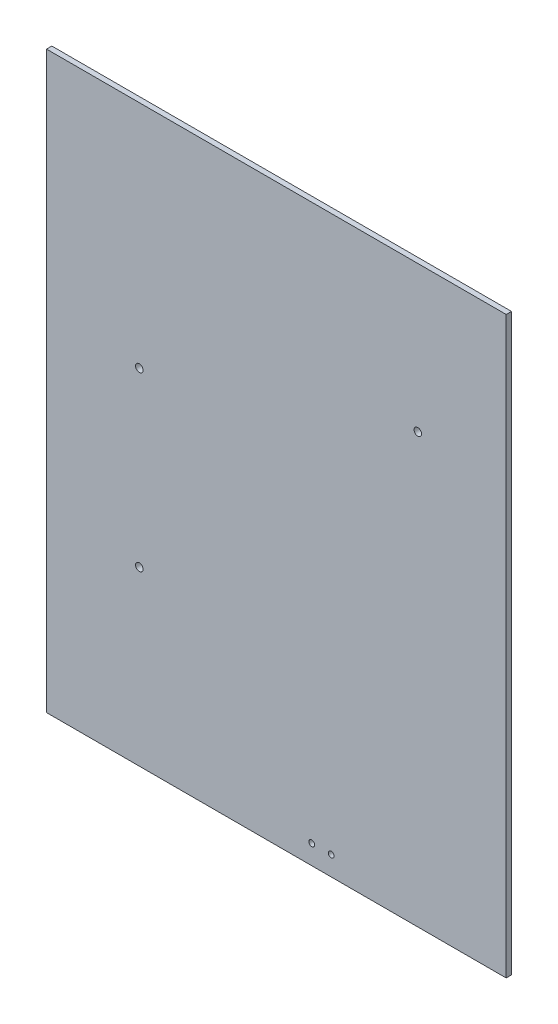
ISO-10303-21;
HEADER;
FILE_DESCRIPTION(('STEP AP214'),'2;1');
FILE_NAME('part.step','',(''),(''),'','','');
FILE_SCHEMA(('AUTOMOTIVE_DESIGN { 1 0 10303 214 1 1 1 1 }'));
ENDSEC;
DATA;
#1=APPLICATION_CONTEXT('core data for automotive mechanical design processes');
#2=APPLICATION_PROTOCOL_DEFINITION('international standard','automotive_design',2000,#1);
#3=PRODUCT_CONTEXT('',#1,'mechanical');
#4=PRODUCT('Part','Part','',(#3));
#5=PRODUCT_RELATED_PRODUCT_CATEGORY('part','',(#4));
#6=PRODUCT_DEFINITION_FORMATION('','',#4);
#7=PRODUCT_DEFINITION_CONTEXT('part definition',#1,'design');
#8=PRODUCT_DEFINITION('design','',#6,#7);
#9=PRODUCT_DEFINITION_SHAPE('','',#8);
#10=(LENGTH_UNIT() NAMED_UNIT(*) SI_UNIT(.MILLI.,.METRE.));
#11=(NAMED_UNIT(*) PLANE_ANGLE_UNIT() SI_UNIT($,.RADIAN.));
#12=(NAMED_UNIT(*) SI_UNIT($,.STERADIAN.) SOLID_ANGLE_UNIT());
#13=UNCERTAINTY_MEASURE_WITH_UNIT(LENGTH_MEASURE(1.E-05),#10,'distance_accuracy_value','');
#14=(GEOMETRIC_REPRESENTATION_CONTEXT(3) GLOBAL_UNCERTAINTY_ASSIGNED_CONTEXT((#13)) GLOBAL_UNIT_ASSIGNED_CONTEXT((#10,
#11,#12)) REPRESENTATION_CONTEXT('',''));
#15=CARTESIAN_POINT('',(0.,0.,0.));
#16=DIRECTION('',(0.,0.,1.));
#17=DIRECTION('',(1.,0.,0.));
#18=AXIS2_PLACEMENT_3D('',#15,#16,#17);
#19=CARTESIAN_POINT('',(0.,0.,6.));
#20=DIRECTION('',(1.,0.,0.));
#21=DIRECTION('',(0.,0.,-1.));
#22=AXIS2_PLACEMENT_3D('',#19,#20,#21);
#23=PLANE('',#22);
#24=DIRECTION('',(0.,-1.,0.));
#25=VECTOR('',#24,1.);
#26=CARTESIAN_POINT('',(0.,0.,0.));
#27=LINE('',#26,#25);
#28=CARTESIAN_POINT('',(0.,650.,0.));
#29=VERTEX_POINT('',#28);
#30=CARTESIAN_POINT('',(0.,0.,0.));
#31=VERTEX_POINT('',#30);
#32=EDGE_CURVE('E76',#29,#31,#27,.T.);
#33=ORIENTED_EDGE('',*,*,#32,.T.);
#34=DIRECTION('',(0.,0.,-1.));
#35=VECTOR('',#34,1.);
#36=CARTESIAN_POINT('',(0.,0.,6.));
#37=LINE('',#36,#35);
#38=CARTESIAN_POINT('',(0.,0.,6.));
#39=VERTEX_POINT('',#38);
#40=EDGE_CURVE('E11',#39,#31,#37,.T.);
#41=ORIENTED_EDGE('',*,*,#40,.F.);
#42=DIRECTION('',(0.,-1.,0.));
#43=VECTOR('',#42,1.);
#44=CARTESIAN_POINT('',(0.,0.,6.));
#45=LINE('',#44,#43);
#46=CARTESIAN_POINT('',(0.,650.,6.));
#47=VERTEX_POINT('',#46);
#48=EDGE_CURVE('E99',#47,#39,#45,.T.);
#49=ORIENTED_EDGE('',*,*,#48,.F.);
#50=DIRECTION('',(0.,0.,-1.));
#51=VECTOR('',#50,1.);
#52=CARTESIAN_POINT('',(0.,650.,6.));
#53=LINE('',#52,#51);
#54=EDGE_CURVE('E88',#47,#29,#53,.T.);
#55=ORIENTED_EDGE('',*,*,#54,.T.);
#56=EDGE_LOOP('',(#33,#41,#49,#55));
#57=FACE_BOUND('',#56,.T.);
#58=ADVANCED_FACE('F32',(#57),#23,.F.);
#59=CARTESIAN_POINT('',(0.,0.,6.));
#60=DIRECTION('',(0.,1.,0.));
#61=DIRECTION('',(0.,0.,1.));
#62=AXIS2_PLACEMENT_3D('',#59,#60,#61);
#63=PLANE('',#62);
#64=DIRECTION('',(1.,0.,0.));
#65=VECTOR('',#64,1.);
#66=CARTESIAN_POINT('',(0.,0.,0.));
#67=LINE('',#66,#65);
#68=CARTESIAN_POINT('',(520.,0.,0.));
#69=VERTEX_POINT('',#68);
#70=EDGE_CURVE('E72',#31,#69,#67,.T.);
#71=ORIENTED_EDGE('',*,*,#70,.T.);
#72=DIRECTION('',(0.,0.,-1.));
#73=VECTOR('',#72,1.);
#74=CARTESIAN_POINT('',(520.,0.,6.));
#75=LINE('',#74,#73);
#76=CARTESIAN_POINT('',(520.,0.,6.));
#77=VERTEX_POINT('',#76);
#78=EDGE_CURVE('E39',#77,#69,#75,.T.);
#79=ORIENTED_EDGE('',*,*,#78,.F.);
#80=DIRECTION('',(1.,0.,0.));
#81=VECTOR('',#80,1.);
#82=CARTESIAN_POINT('',(0.,0.,6.));
#83=LINE('',#82,#81);
#84=EDGE_CURVE('E84',#39,#77,#83,.T.);
#85=ORIENTED_EDGE('',*,*,#84,.F.);
#86=ORIENTED_EDGE('',*,*,#40,.T.);
#87=EDGE_LOOP('',(#71,#79,#85,#86));
#88=FACE_BOUND('',#87,.T.);
#89=ADVANCED_FACE('F83',(#88),#63,.F.);
#90=CARTESIAN_POINT('',(520.,0.,6.));
#91=DIRECTION('',(-1.,0.,0.));
#92=DIRECTION('',(0.,0.,1.));
#93=AXIS2_PLACEMENT_3D('',#90,#91,#92);
#94=PLANE('',#93);
#95=DIRECTION('',(0.,1.,0.));
#96=VECTOR('',#95,1.);
#97=CARTESIAN_POINT('',(520.,0.,0.));
#98=LINE('',#97,#96);
#99=CARTESIAN_POINT('',(520.,650.,0.));
#100=VERTEX_POINT('',#99);
#101=EDGE_CURVE('E77',#69,#100,#98,.T.);
#102=ORIENTED_EDGE('',*,*,#101,.T.);
#103=DIRECTION('',(0.,0.,-1.));
#104=VECTOR('',#103,1.);
#105=CARTESIAN_POINT('',(520.,650.,6.));
#106=LINE('',#105,#104);
#107=CARTESIAN_POINT('',(520.,650.,6.));
#108=VERTEX_POINT('',#107);
#109=EDGE_CURVE('E105',#108,#100,#106,.T.);
#110=ORIENTED_EDGE('',*,*,#109,.F.);
#111=DIRECTION('',(0.,1.,0.));
#112=VECTOR('',#111,1.);
#113=CARTESIAN_POINT('',(520.,0.,6.));
#114=LINE('',#113,#112);
#115=EDGE_CURVE('E51',#77,#108,#114,.T.);
#116=ORIENTED_EDGE('',*,*,#115,.F.);
#117=ORIENTED_EDGE('',*,*,#78,.T.);
#118=EDGE_LOOP('',(#102,#110,#116,#117));
#119=FACE_BOUND('',#118,.T.);
#120=ADVANCED_FACE('F108',(#119),#94,.F.);
#121=CARTESIAN_POINT('',(0.,650.,6.));
#122=DIRECTION('',(0.,-1.,0.));
#123=DIRECTION('',(0.,0.,-1.));
#124=AXIS2_PLACEMENT_3D('',#121,#122,#123);
#125=PLANE('',#124);
#126=DIRECTION('',(-1.,0.,0.));
#127=VECTOR('',#126,1.);
#128=CARTESIAN_POINT('',(0.,650.,0.));
#129=LINE('',#128,#127);
#130=EDGE_CURVE('E97',#100,#29,#129,.T.);
#131=ORIENTED_EDGE('',*,*,#130,.T.);
#132=ORIENTED_EDGE('',*,*,#54,.F.);
#133=DIRECTION('',(-1.,0.,0.));
#134=VECTOR('',#133,1.);
#135=CARTESIAN_POINT('',(0.,650.,6.));
#136=LINE('',#135,#134);
#137=EDGE_CURVE('E46',#108,#47,#136,.T.);
#138=ORIENTED_EDGE('',*,*,#137,.F.);
#139=ORIENTED_EDGE('',*,*,#109,.T.);
#140=EDGE_LOOP('',(#131,#132,#138,#139));
#141=FACE_BOUND('',#140,.T.);
#142=ADVANCED_FACE('F110',(#141),#125,.F.);
#143=CARTESIAN_POINT('',(0.,650.,6.));
#144=DIRECTION('',(0.,0.,-1.));
#145=DIRECTION('',(-1.,0.,0.));
#146=AXIS2_PLACEMENT_3D('',#143,#144,#145);
#147=PLANE('',#146);
#148=CARTESIAN_POINT('',(322.,22.,6.));
#149=DIRECTION('',(0.,0.,1.));
#150=DIRECTION('',(1.,0.,0.));
#151=AXIS2_PLACEMENT_3D('',#148,#149,#150);
#152=CIRCLE('',#151,3.24999999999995);
#153=CARTESIAN_POINT('',(325.25,22.,6.));
#154=VERTEX_POINT('',#153);
#155=EDGE_CURVE('E207',#154,#154,#152,.T.);
#156=ORIENTED_EDGE('',*,*,#155,.F.);
#157=EDGE_LOOP('',(#156));
#158=FACE_BOUND('',#157,.T.);
#159=CARTESIAN_POINT('',(300.,22.,6.));
#160=DIRECTION('',(0.,0.,1.));
#161=DIRECTION('',(1.,0.,0.));
#162=AXIS2_PLACEMENT_3D('',#159,#160,#161);
#163=CIRCLE('',#162,3.25000000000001);
#164=CARTESIAN_POINT('',(303.25,22.,6.));
#165=VERTEX_POINT('',#164);
#166=EDGE_CURVE('E211',#165,#165,#163,.T.);
#167=ORIENTED_EDGE('',*,*,#166,.F.);
#168=EDGE_LOOP('',(#167));
#169=FACE_BOUND('',#168,.T.);
#170=CARTESIAN_POINT('',(105.,195.,6.));
#171=DIRECTION('',(0.,0.,1.));
#172=DIRECTION('',(1.,0.,0.));
#173=AXIS2_PLACEMENT_3D('',#170,#171,#172);
#174=CIRCLE('',#173,4.25000000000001);
#175=CARTESIAN_POINT('',(109.25,195.,6.));
#176=VERTEX_POINT('',#175);
#177=EDGE_CURVE('E218',#176,#176,#174,.T.);
#178=ORIENTED_EDGE('',*,*,#177,.F.);
#179=EDGE_LOOP('',(#178));
#180=FACE_BOUND('',#179,.T.);
#181=CARTESIAN_POINT('',(105.,390.,6.));
#182=DIRECTION('',(0.,0.,1.));
#183=DIRECTION('',(1.,0.,0.));
#184=AXIS2_PLACEMENT_3D('',#181,#182,#183);
#185=CIRCLE('',#184,4.24999999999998);
#186=CARTESIAN_POINT('',(109.25,390.,6.));
#187=VERTEX_POINT('',#186);
#188=EDGE_CURVE('E224',#187,#187,#185,.T.);
#189=ORIENTED_EDGE('',*,*,#188,.F.);
#190=EDGE_LOOP('',(#189));
#191=FACE_BOUND('',#190,.T.);
#192=CARTESIAN_POINT('',(420.,485.,6.));
#193=DIRECTION('',(0.,0.,1.));
#194=DIRECTION('',(1.,0.,0.));
#195=AXIS2_PLACEMENT_3D('',#192,#193,#194);
#196=CIRCLE('',#195,4.24999999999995);
#197=CARTESIAN_POINT('',(424.25,485.,6.));
#198=VERTEX_POINT('',#197);
#199=EDGE_CURVE('E89',#198,#198,#196,.T.);
#200=ORIENTED_EDGE('',*,*,#199,.F.);
#201=EDGE_LOOP('',(#200));
#202=FACE_BOUND('',#201,.T.);
#203=ORIENTED_EDGE('',*,*,#48,.T.);
#204=ORIENTED_EDGE('',*,*,#84,.T.);
#205=ORIENTED_EDGE('',*,*,#115,.T.);
#206=ORIENTED_EDGE('',*,*,#137,.T.);
#207=EDGE_LOOP('',(#203,#204,#205,#206));
#208=FACE_BOUND('',#207,.T.);
#209=ADVANCED_FACE('F111',(#158,#169,#180,#191,#202,#208),#147,.F.);
#210=CARTESIAN_POINT('',(0.,650.,0.));
#211=DIRECTION('',(0.,0.,-1.));
#212=DIRECTION('',(-1.,0.,0.));
#213=AXIS2_PLACEMENT_3D('',#210,#211,#212);
#214=PLANE('',#213);
#215=CARTESIAN_POINT('',(322.,22.,0.));
#216=DIRECTION('',(0.,0.,-1.));
#217=DIRECTION('',(-1.,0.,0.));
#218=AXIS2_PLACEMENT_3D('',#215,#216,#217);
#219=CIRCLE('',#218,3.24999999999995);
#220=CARTESIAN_POINT('',(325.25,22.,0.));
#221=VERTEX_POINT('',#220);
#222=EDGE_CURVE('E205',#221,#221,#219,.F.);
#223=ORIENTED_EDGE('',*,*,#222,.T.);
#224=EDGE_LOOP('',(#223));
#225=FACE_BOUND('',#224,.T.);
#226=CARTESIAN_POINT('',(300.,22.,0.));
#227=DIRECTION('',(0.,0.,-1.));
#228=DIRECTION('',(-1.,0.,0.));
#229=AXIS2_PLACEMENT_3D('',#226,#227,#228);
#230=CIRCLE('',#229,3.25000000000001);
#231=CARTESIAN_POINT('',(303.25,22.,0.));
#232=VERTEX_POINT('',#231);
#233=EDGE_CURVE('E208',#232,#232,#230,.F.);
#234=ORIENTED_EDGE('',*,*,#233,.T.);
#235=EDGE_LOOP('',(#234));
#236=FACE_BOUND('',#235,.T.);
#237=CARTESIAN_POINT('',(105.,195.,0.));
#238=DIRECTION('',(0.,0.,-1.));
#239=DIRECTION('',(-1.,0.,0.));
#240=AXIS2_PLACEMENT_3D('',#237,#238,#239);
#241=CIRCLE('',#240,4.25000000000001);
#242=CARTESIAN_POINT('',(109.25,195.,0.));
#243=VERTEX_POINT('',#242);
#244=EDGE_CURVE('E216',#243,#243,#241,.F.);
#245=ORIENTED_EDGE('',*,*,#244,.T.);
#246=EDGE_LOOP('',(#245));
#247=FACE_BOUND('',#246,.T.);
#248=CARTESIAN_POINT('',(105.,390.,0.));
#249=DIRECTION('',(0.,0.,-1.));
#250=DIRECTION('',(-1.,0.,0.));
#251=AXIS2_PLACEMENT_3D('',#248,#249,#250);
#252=CIRCLE('',#251,4.24999999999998);
#253=CARTESIAN_POINT('',(109.25,390.,0.));
#254=VERTEX_POINT('',#253);
#255=EDGE_CURVE('E221',#254,#254,#252,.F.);
#256=ORIENTED_EDGE('',*,*,#255,.T.);
#257=EDGE_LOOP('',(#256));
#258=FACE_BOUND('',#257,.T.);
#259=CARTESIAN_POINT('',(420.,485.,0.));
#260=DIRECTION('',(0.,0.,-1.));
#261=DIRECTION('',(-1.,0.,0.));
#262=AXIS2_PLACEMENT_3D('',#259,#260,#261);
#263=CIRCLE('',#262,4.24999999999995);
#264=CARTESIAN_POINT('',(424.25,485.,0.));
#265=VERTEX_POINT('',#264);
#266=EDGE_CURVE('E92',#265,#265,#263,.F.);
#267=ORIENTED_EDGE('',*,*,#266,.T.);
#268=EDGE_LOOP('',(#267));
#269=FACE_BOUND('',#268,.T.);
#270=ORIENTED_EDGE('',*,*,#32,.F.);
#271=ORIENTED_EDGE('',*,*,#130,.F.);
#272=ORIENTED_EDGE('',*,*,#101,.F.);
#273=ORIENTED_EDGE('',*,*,#70,.F.);
#274=EDGE_LOOP('',(#270,#271,#272,#273));
#275=FACE_BOUND('',#274,.T.);
#276=ADVANCED_FACE('F73',(#225,#236,#247,#258,#269,#275),#214,.T.);
#277=CARTESIAN_POINT('',(420.,485.,-0.00100000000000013));
#278=DIRECTION('',(0.,0.,1.));
#279=DIRECTION('',(1.,0.,0.));
#280=AXIS2_PLACEMENT_3D('',#277,#278,#279);
#281=CYLINDRICAL_SURFACE('',#280,4.24999999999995);
#282=CARTESIAN_POINT('',(424.25,485.,0.));
#283=CARTESIAN_POINT('',(424.25,485.,0.0624999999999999));
#284=CARTESIAN_POINT('',(424.25,485.,0.125));
#285=CARTESIAN_POINT('',(424.25,485.,0.25));
#286=CARTESIAN_POINT('',(424.25,485.,0.3125));
#287=CARTESIAN_POINT('',(424.25,485.,0.4375));
#288=CARTESIAN_POINT('',(424.25,485.,0.5));
#289=CARTESIAN_POINT('',(424.25,485.,0.625));
#290=CARTESIAN_POINT('',(424.25,485.,0.6875));
#291=CARTESIAN_POINT('',(424.25,485.,0.8125));
#292=CARTESIAN_POINT('',(424.25,485.,0.875));
#293=CARTESIAN_POINT('',(424.25,485.,1.));
#294=CARTESIAN_POINT('',(424.25,485.,1.0625));
#295=CARTESIAN_POINT('',(424.25,485.,1.1875));
#296=CARTESIAN_POINT('',(424.25,485.,1.25));
#297=CARTESIAN_POINT('',(424.25,485.,1.375));
#298=CARTESIAN_POINT('',(424.25,485.,1.4375));
#299=CARTESIAN_POINT('',(424.25,485.,1.5625));
#300=CARTESIAN_POINT('',(424.25,485.,1.625));
#301=CARTESIAN_POINT('',(424.25,485.,1.75));
#302=CARTESIAN_POINT('',(424.25,485.,1.8125));
#303=CARTESIAN_POINT('',(424.25,485.,1.9375));
#304=CARTESIAN_POINT('',(424.25,485.,2.));
#305=CARTESIAN_POINT('',(424.25,485.,2.125));
#306=CARTESIAN_POINT('',(424.25,485.,2.1875));
#307=CARTESIAN_POINT('',(424.25,485.,2.3125));
#308=CARTESIAN_POINT('',(424.25,485.,2.375));
#309=CARTESIAN_POINT('',(424.25,485.,2.5));
#310=CARTESIAN_POINT('',(424.25,485.,2.5625));
#311=CARTESIAN_POINT('',(424.25,485.,2.6875));
#312=CARTESIAN_POINT('',(424.25,485.,2.75));
#313=CARTESIAN_POINT('',(424.25,485.,2.875));
#314=CARTESIAN_POINT('',(424.25,485.,2.9375));
#315=CARTESIAN_POINT('',(424.25,485.,3.0625));
#316=CARTESIAN_POINT('',(424.25,485.,3.125));
#317=CARTESIAN_POINT('',(424.25,485.,3.25));
#318=CARTESIAN_POINT('',(424.25,485.,3.3125));
#319=CARTESIAN_POINT('',(424.25,485.,3.4375));
#320=CARTESIAN_POINT('',(424.25,485.,3.5));
#321=CARTESIAN_POINT('',(424.25,485.,3.625));
#322=CARTESIAN_POINT('',(424.25,485.,3.6875));
#323=CARTESIAN_POINT('',(424.25,485.,3.8125));
#324=CARTESIAN_POINT('',(424.25,485.,3.875));
#325=CARTESIAN_POINT('',(424.25,485.,4.));
#326=CARTESIAN_POINT('',(424.25,485.,4.0625));
#327=CARTESIAN_POINT('',(424.25,485.,4.1875));
#328=CARTESIAN_POINT('',(424.25,485.,4.25));
#329=CARTESIAN_POINT('',(424.25,485.,4.375));
#330=CARTESIAN_POINT('',(424.25,485.,4.4375));
#331=CARTESIAN_POINT('',(424.25,485.,4.5625));
#332=CARTESIAN_POINT('',(424.25,485.,4.625));
#333=CARTESIAN_POINT('',(424.25,485.,4.75));
#334=CARTESIAN_POINT('',(424.25,485.,4.8125));
#335=CARTESIAN_POINT('',(424.25,485.,4.9375));
#336=CARTESIAN_POINT('',(424.25,485.,5.));
#337=CARTESIAN_POINT('',(424.25,485.,5.125));
#338=CARTESIAN_POINT('',(424.25,485.,5.1875));
#339=CARTESIAN_POINT('',(424.25,485.,5.3125));
#340=CARTESIAN_POINT('',(424.25,485.,5.375));
#341=CARTESIAN_POINT('',(424.25,485.,5.5));
#342=CARTESIAN_POINT('',(424.25,485.,5.5625));
#343=CARTESIAN_POINT('',(424.25,485.,5.6875));
#344=CARTESIAN_POINT('',(424.25,485.,5.75));
#345=CARTESIAN_POINT('',(424.25,485.,5.875));
#346=CARTESIAN_POINT('',(424.25,485.,5.9375));
#347=CARTESIAN_POINT('',(424.25,485.,6.));
#348=B_SPLINE_CURVE_WITH_KNOTS('',3,(#282,#283,#284,#285,#286,#287,#288,#289,#290,#291,#292,
#293,#294,#295,#296,#297,#298,#299,#300,#301,#302,#303,#304,#305,#306,#307,#308,#309,#310,#311,
#312,#313,#314,#315,#316,#317,#318,#319,#320,#321,#322,#323,#324,#325,#326,#327,#328,#329,#330,
#331,#332,#333,#334,#335,#336,#337,#338,#339,#340,#341,#342,#343,#344,#345,#346,#347),
.UNSPECIFIED.,.F.,.F.,(4,2,2,2,2,2,2,2,2,2,2,2,2,2,2,2,2,2,2,2,2,2,2,2,2,2,2,2,2,2,2,2,4),(0.,
0.1875,0.375,0.5625,0.75,0.9375,1.125,1.3125,1.5,1.6875,1.875,2.0625,2.25,2.4375,2.625,2.8125,
3.,3.1875,3.375,3.5625,3.75,3.9375,4.125,4.3125,4.5,4.6875,4.875,5.0625,5.25,5.4375,5.625,
5.8125,6.),.UNSPECIFIED.);
#349=EDGE_CURVE('BSEAM119',#265,#198,#348,.T.);
#350=ORIENTED_EDGE('',*,*,#266,.F.);
#351=ORIENTED_EDGE('',*,*,#199,.T.);
#352=ORIENTED_EDGE('',*,*,#349,.T.);
#353=ORIENTED_EDGE('',*,*,#349,.F.);
#354=EDGE_LOOP('',(#350,#352,#351,#353));
#355=FACE_BOUND('',#354,.T.);
#356=ADVANCED_FACE('F119',(#355),#281,.F.);
#357=CARTESIAN_POINT('',(105.,390.,-0.00100000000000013));
#358=DIRECTION('',(0.,0.,1.));
#359=DIRECTION('',(1.,0.,0.));
#360=AXIS2_PLACEMENT_3D('',#357,#358,#359);
#361=CYLINDRICAL_SURFACE('',#360,4.24999999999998);
#362=CARTESIAN_POINT('',(109.25,390.,0.));
#363=CARTESIAN_POINT('',(109.25,390.,0.0624999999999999));
#364=CARTESIAN_POINT('',(109.25,390.,0.125));
#365=CARTESIAN_POINT('',(109.25,390.,0.25));
#366=CARTESIAN_POINT('',(109.25,390.,0.3125));
#367=CARTESIAN_POINT('',(109.25,390.,0.4375));
#368=CARTESIAN_POINT('',(109.25,390.,0.5));
#369=CARTESIAN_POINT('',(109.25,390.,0.625));
#370=CARTESIAN_POINT('',(109.25,390.,0.6875));
#371=CARTESIAN_POINT('',(109.25,390.,0.8125));
#372=CARTESIAN_POINT('',(109.25,390.,0.875));
#373=CARTESIAN_POINT('',(109.25,390.,1.));
#374=CARTESIAN_POINT('',(109.25,390.,1.0625));
#375=CARTESIAN_POINT('',(109.25,390.,1.1875));
#376=CARTESIAN_POINT('',(109.25,390.,1.25));
#377=CARTESIAN_POINT('',(109.25,390.,1.375));
#378=CARTESIAN_POINT('',(109.25,390.,1.4375));
#379=CARTESIAN_POINT('',(109.25,390.,1.5625));
#380=CARTESIAN_POINT('',(109.25,390.,1.625));
#381=CARTESIAN_POINT('',(109.25,390.,1.75));
#382=CARTESIAN_POINT('',(109.25,390.,1.8125));
#383=CARTESIAN_POINT('',(109.25,390.,1.9375));
#384=CARTESIAN_POINT('',(109.25,390.,2.));
#385=CARTESIAN_POINT('',(109.25,390.,2.125));
#386=CARTESIAN_POINT('',(109.25,390.,2.1875));
#387=CARTESIAN_POINT('',(109.25,390.,2.3125));
#388=CARTESIAN_POINT('',(109.25,390.,2.375));
#389=CARTESIAN_POINT('',(109.25,390.,2.5));
#390=CARTESIAN_POINT('',(109.25,390.,2.5625));
#391=CARTESIAN_POINT('',(109.25,390.,2.6875));
#392=CARTESIAN_POINT('',(109.25,390.,2.75));
#393=CARTESIAN_POINT('',(109.25,390.,2.875));
#394=CARTESIAN_POINT('',(109.25,390.,2.9375));
#395=CARTESIAN_POINT('',(109.25,390.,3.0625));
#396=CARTESIAN_POINT('',(109.25,390.,3.125));
#397=CARTESIAN_POINT('',(109.25,390.,3.25));
#398=CARTESIAN_POINT('',(109.25,390.,3.3125));
#399=CARTESIAN_POINT('',(109.25,390.,3.4375));
#400=CARTESIAN_POINT('',(109.25,390.,3.5));
#401=CARTESIAN_POINT('',(109.25,390.,3.625));
#402=CARTESIAN_POINT('',(109.25,390.,3.6875));
#403=CARTESIAN_POINT('',(109.25,390.,3.8125));
#404=CARTESIAN_POINT('',(109.25,390.,3.875));
#405=CARTESIAN_POINT('',(109.25,390.,4.));
#406=CARTESIAN_POINT('',(109.25,390.,4.0625));
#407=CARTESIAN_POINT('',(109.25,390.,4.1875));
#408=CARTESIAN_POINT('',(109.25,390.,4.25));
#409=CARTESIAN_POINT('',(109.25,390.,4.375));
#410=CARTESIAN_POINT('',(109.25,390.,4.4375));
#411=CARTESIAN_POINT('',(109.25,390.,4.5625));
#412=CARTESIAN_POINT('',(109.25,390.,4.625));
#413=CARTESIAN_POINT('',(109.25,390.,4.75));
#414=CARTESIAN_POINT('',(109.25,390.,4.8125));
#415=CARTESIAN_POINT('',(109.25,390.,4.9375));
#416=CARTESIAN_POINT('',(109.25,390.,5.));
#417=CARTESIAN_POINT('',(109.25,390.,5.125));
#418=CARTESIAN_POINT('',(109.25,390.,5.1875));
#419=CARTESIAN_POINT('',(109.25,390.,5.3125));
#420=CARTESIAN_POINT('',(109.25,390.,5.375));
#421=CARTESIAN_POINT('',(109.25,390.,5.5));
#422=CARTESIAN_POINT('',(109.25,390.,5.5625));
#423=CARTESIAN_POINT('',(109.25,390.,5.6875));
#424=CARTESIAN_POINT('',(109.25,390.,5.75));
#425=CARTESIAN_POINT('',(109.25,390.,5.875));
#426=CARTESIAN_POINT('',(109.25,390.,5.9375));
#427=CARTESIAN_POINT('',(109.25,390.,6.));
#428=B_SPLINE_CURVE_WITH_KNOTS('',3,(#362,#363,#364,#365,#366,#367,#368,#369,#370,#371,#372,
#373,#374,#375,#376,#377,#378,#379,#380,#381,#382,#383,#384,#385,#386,#387,#388,#389,#390,#391,
#392,#393,#394,#395,#396,#397,#398,#399,#400,#401,#402,#403,#404,#405,#406,#407,#408,#409,#410,
#411,#412,#413,#414,#415,#416,#417,#418,#419,#420,#421,#422,#423,#424,#425,#426,#427),
.UNSPECIFIED.,.F.,.F.,(4,2,2,2,2,2,2,2,2,2,2,2,2,2,2,2,2,2,2,2,2,2,2,2,2,2,2,2,2,2,2,2,4),(0.,
0.1875,0.375,0.5625,0.75,0.9375,1.125,1.3125,1.5,1.6875,1.875,2.0625,2.25,2.4375,2.625,2.8125,
3.,3.1875,3.375,3.5625,3.75,3.9375,4.125,4.3125,4.5,4.6875,4.875,5.0625,5.25,5.4375,5.625,
5.8125,6.),.UNSPECIFIED.);
#429=EDGE_CURVE('BSEAM158',#254,#187,#428,.T.);
#430=ORIENTED_EDGE('',*,*,#255,.F.);
#431=ORIENTED_EDGE('',*,*,#188,.T.);
#432=ORIENTED_EDGE('',*,*,#429,.T.);
#433=ORIENTED_EDGE('',*,*,#429,.F.);
#434=EDGE_LOOP('',(#430,#432,#431,#433));
#435=FACE_BOUND('',#434,.T.);
#436=ADVANCED_FACE('F158',(#435),#361,.F.);
#437=CARTESIAN_POINT('',(105.,195.,-0.00100000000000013));
#438=DIRECTION('',(0.,0.,1.));
#439=DIRECTION('',(1.,0.,0.));
#440=AXIS2_PLACEMENT_3D('',#437,#438,#439);
#441=CYLINDRICAL_SURFACE('',#440,4.25000000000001);
#442=CARTESIAN_POINT('',(109.25,195.,0.));
#443=CARTESIAN_POINT('',(109.25,195.,0.0624999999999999));
#444=CARTESIAN_POINT('',(109.25,195.,0.125));
#445=CARTESIAN_POINT('',(109.25,195.,0.25));
#446=CARTESIAN_POINT('',(109.25,195.,0.3125));
#447=CARTESIAN_POINT('',(109.25,195.,0.4375));
#448=CARTESIAN_POINT('',(109.25,195.,0.5));
#449=CARTESIAN_POINT('',(109.25,195.,0.625));
#450=CARTESIAN_POINT('',(109.25,195.,0.6875));
#451=CARTESIAN_POINT('',(109.25,195.,0.8125));
#452=CARTESIAN_POINT('',(109.25,195.,0.875));
#453=CARTESIAN_POINT('',(109.25,195.,1.));
#454=CARTESIAN_POINT('',(109.25,195.,1.0625));
#455=CARTESIAN_POINT('',(109.25,195.,1.1875));
#456=CARTESIAN_POINT('',(109.25,195.,1.25));
#457=CARTESIAN_POINT('',(109.25,195.,1.375));
#458=CARTESIAN_POINT('',(109.25,195.,1.4375));
#459=CARTESIAN_POINT('',(109.25,195.,1.5625));
#460=CARTESIAN_POINT('',(109.25,195.,1.625));
#461=CARTESIAN_POINT('',(109.25,195.,1.75));
#462=CARTESIAN_POINT('',(109.25,195.,1.8125));
#463=CARTESIAN_POINT('',(109.25,195.,1.9375));
#464=CARTESIAN_POINT('',(109.25,195.,2.));
#465=CARTESIAN_POINT('',(109.25,195.,2.125));
#466=CARTESIAN_POINT('',(109.25,195.,2.1875));
#467=CARTESIAN_POINT('',(109.25,195.,2.3125));
#468=CARTESIAN_POINT('',(109.25,195.,2.375));
#469=CARTESIAN_POINT('',(109.25,195.,2.5));
#470=CARTESIAN_POINT('',(109.25,195.,2.5625));
#471=CARTESIAN_POINT('',(109.25,195.,2.6875));
#472=CARTESIAN_POINT('',(109.25,195.,2.75));
#473=CARTESIAN_POINT('',(109.25,195.,2.875));
#474=CARTESIAN_POINT('',(109.25,195.,2.9375));
#475=CARTESIAN_POINT('',(109.25,195.,3.0625));
#476=CARTESIAN_POINT('',(109.25,195.,3.125));
#477=CARTESIAN_POINT('',(109.25,195.,3.25));
#478=CARTESIAN_POINT('',(109.25,195.,3.3125));
#479=CARTESIAN_POINT('',(109.25,195.,3.4375));
#480=CARTESIAN_POINT('',(109.25,195.,3.5));
#481=CARTESIAN_POINT('',(109.25,195.,3.625));
#482=CARTESIAN_POINT('',(109.25,195.,3.6875));
#483=CARTESIAN_POINT('',(109.25,195.,3.8125));
#484=CARTESIAN_POINT('',(109.25,195.,3.875));
#485=CARTESIAN_POINT('',(109.25,195.,4.));
#486=CARTESIAN_POINT('',(109.25,195.,4.0625));
#487=CARTESIAN_POINT('',(109.25,195.,4.1875));
#488=CARTESIAN_POINT('',(109.25,195.,4.25));
#489=CARTESIAN_POINT('',(109.25,195.,4.375));
#490=CARTESIAN_POINT('',(109.25,195.,4.4375));
#491=CARTESIAN_POINT('',(109.25,195.,4.5625));
#492=CARTESIAN_POINT('',(109.25,195.,4.625));
#493=CARTESIAN_POINT('',(109.25,195.,4.75));
#494=CARTESIAN_POINT('',(109.25,195.,4.8125));
#495=CARTESIAN_POINT('',(109.25,195.,4.9375));
#496=CARTESIAN_POINT('',(109.25,195.,5.));
#497=CARTESIAN_POINT('',(109.25,195.,5.125));
#498=CARTESIAN_POINT('',(109.25,195.,5.1875));
#499=CARTESIAN_POINT('',(109.25,195.,5.3125));
#500=CARTESIAN_POINT('',(109.25,195.,5.375));
#501=CARTESIAN_POINT('',(109.25,195.,5.5));
#502=CARTESIAN_POINT('',(109.25,195.,5.5625));
#503=CARTESIAN_POINT('',(109.25,195.,5.6875));
#504=CARTESIAN_POINT('',(109.25,195.,5.75));
#505=CARTESIAN_POINT('',(109.25,195.,5.875));
#506=CARTESIAN_POINT('',(109.25,195.,5.9375));
#507=CARTESIAN_POINT('',(109.25,195.,6.));
#508=B_SPLINE_CURVE_WITH_KNOTS('',3,(#442,#443,#444,#445,#446,#447,#448,#449,#450,#451,#452,
#453,#454,#455,#456,#457,#458,#459,#460,#461,#462,#463,#464,#465,#466,#467,#468,#469,#470,#471,
#472,#473,#474,#475,#476,#477,#478,#479,#480,#481,#482,#483,#484,#485,#486,#487,#488,#489,#490,
#491,#492,#493,#494,#495,#496,#497,#498,#499,#500,#501,#502,#503,#504,#505,#506,#507),
.UNSPECIFIED.,.F.,.F.,(4,2,2,2,2,2,2,2,2,2,2,2,2,2,2,2,2,2,2,2,2,2,2,2,2,2,2,2,2,2,2,2,4),(0.,
0.1875,0.375,0.5625,0.75,0.9375,1.125,1.3125,1.5,1.6875,1.875,2.0625,2.25,2.4375,2.625,2.8125,
3.,3.1875,3.375,3.5625,3.75,3.9375,4.125,4.3125,4.5,4.6875,4.875,5.0625,5.25,5.4375,5.625,
5.8125,6.),.UNSPECIFIED.);
#509=EDGE_CURVE('BSEAM168',#243,#176,#508,.T.);
#510=ORIENTED_EDGE('',*,*,#244,.F.);
#511=ORIENTED_EDGE('',*,*,#177,.T.);
#512=ORIENTED_EDGE('',*,*,#509,.T.);
#513=ORIENTED_EDGE('',*,*,#509,.F.);
#514=EDGE_LOOP('',(#510,#512,#511,#513));
#515=FACE_BOUND('',#514,.T.);
#516=ADVANCED_FACE('F168',(#515),#441,.F.);
#517=CARTESIAN_POINT('',(300.,22.,-0.00100000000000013));
#518=DIRECTION('',(0.,0.,1.));
#519=DIRECTION('',(1.,0.,0.));
#520=AXIS2_PLACEMENT_3D('',#517,#518,#519);
#521=CYLINDRICAL_SURFACE('',#520,3.25000000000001);
#522=CARTESIAN_POINT('',(303.25,22.,0.));
#523=CARTESIAN_POINT('',(303.25,22.,0.0624999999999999));
#524=CARTESIAN_POINT('',(303.25,22.,0.125));
#525=CARTESIAN_POINT('',(303.25,22.,0.25));
#526=CARTESIAN_POINT('',(303.25,22.,0.3125));
#527=CARTESIAN_POINT('',(303.25,22.,0.4375));
#528=CARTESIAN_POINT('',(303.25,22.,0.5));
#529=CARTESIAN_POINT('',(303.25,22.,0.625));
#530=CARTESIAN_POINT('',(303.25,22.,0.6875));
#531=CARTESIAN_POINT('',(303.25,22.,0.8125));
#532=CARTESIAN_POINT('',(303.25,22.,0.875));
#533=CARTESIAN_POINT('',(303.25,22.,1.));
#534=CARTESIAN_POINT('',(303.25,22.,1.0625));
#535=CARTESIAN_POINT('',(303.25,22.,1.1875));
#536=CARTESIAN_POINT('',(303.25,22.,1.25));
#537=CARTESIAN_POINT('',(303.25,22.,1.375));
#538=CARTESIAN_POINT('',(303.25,22.,1.4375));
#539=CARTESIAN_POINT('',(303.25,22.,1.5625));
#540=CARTESIAN_POINT('',(303.25,22.,1.625));
#541=CARTESIAN_POINT('',(303.25,22.,1.75));
#542=CARTESIAN_POINT('',(303.25,22.,1.8125));
#543=CARTESIAN_POINT('',(303.25,22.,1.9375));
#544=CARTESIAN_POINT('',(303.25,22.,2.));
#545=CARTESIAN_POINT('',(303.25,22.,2.125));
#546=CARTESIAN_POINT('',(303.25,22.,2.1875));
#547=CARTESIAN_POINT('',(303.25,22.,2.3125));
#548=CARTESIAN_POINT('',(303.25,22.,2.375));
#549=CARTESIAN_POINT('',(303.25,22.,2.5));
#550=CARTESIAN_POINT('',(303.25,22.,2.5625));
#551=CARTESIAN_POINT('',(303.25,22.,2.6875));
#552=CARTESIAN_POINT('',(303.25,22.,2.75));
#553=CARTESIAN_POINT('',(303.25,22.,2.875));
#554=CARTESIAN_POINT('',(303.25,22.,2.9375));
#555=CARTESIAN_POINT('',(303.25,22.,3.0625));
#556=CARTESIAN_POINT('',(303.25,22.,3.125));
#557=CARTESIAN_POINT('',(303.25,22.,3.25));
#558=CARTESIAN_POINT('',(303.25,22.,3.3125));
#559=CARTESIAN_POINT('',(303.25,22.,3.4375));
#560=CARTESIAN_POINT('',(303.25,22.,3.5));
#561=CARTESIAN_POINT('',(303.25,22.,3.625));
#562=CARTESIAN_POINT('',(303.25,22.,3.6875));
#563=CARTESIAN_POINT('',(303.25,22.,3.8125));
#564=CARTESIAN_POINT('',(303.25,22.,3.875));
#565=CARTESIAN_POINT('',(303.25,22.,4.));
#566=CARTESIAN_POINT('',(303.25,22.,4.0625));
#567=CARTESIAN_POINT('',(303.25,22.,4.1875));
#568=CARTESIAN_POINT('',(303.25,22.,4.25));
#569=CARTESIAN_POINT('',(303.25,22.,4.375));
#570=CARTESIAN_POINT('',(303.25,22.,4.4375));
#571=CARTESIAN_POINT('',(303.25,22.,4.5625));
#572=CARTESIAN_POINT('',(303.25,22.,4.625));
#573=CARTESIAN_POINT('',(303.25,22.,4.75));
#574=CARTESIAN_POINT('',(303.25,22.,4.8125));
#575=CARTESIAN_POINT('',(303.25,22.,4.9375));
#576=CARTESIAN_POINT('',(303.25,22.,5.));
#577=CARTESIAN_POINT('',(303.25,22.,5.125));
#578=CARTESIAN_POINT('',(303.25,22.,5.1875));
#579=CARTESIAN_POINT('',(303.25,22.,5.3125));
#580=CARTESIAN_POINT('',(303.25,22.,5.375));
#581=CARTESIAN_POINT('',(303.25,22.,5.5));
#582=CARTESIAN_POINT('',(303.25,22.,5.5625));
#583=CARTESIAN_POINT('',(303.25,22.,5.6875));
#584=CARTESIAN_POINT('',(303.25,22.,5.75));
#585=CARTESIAN_POINT('',(303.25,22.,5.875));
#586=CARTESIAN_POINT('',(303.25,22.,5.9375));
#587=CARTESIAN_POINT('',(303.25,22.,6.));
#588=B_SPLINE_CURVE_WITH_KNOTS('',3,(#522,#523,#524,#525,#526,#527,#528,#529,#530,#531,#532,
#533,#534,#535,#536,#537,#538,#539,#540,#541,#542,#543,#544,#545,#546,#547,#548,#549,#550,#551,
#552,#553,#554,#555,#556,#557,#558,#559,#560,#561,#562,#563,#564,#565,#566,#567,#568,#569,#570,
#571,#572,#573,#574,#575,#576,#577,#578,#579,#580,#581,#582,#583,#584,#585,#586,#587),
.UNSPECIFIED.,.F.,.F.,(4,2,2,2,2,2,2,2,2,2,2,2,2,2,2,2,2,2,2,2,2,2,2,2,2,2,2,2,2,2,2,2,4),(0.,
0.1875,0.375,0.5625,0.75,0.9375,1.125,1.3125,1.5,1.6875,1.875,2.0625,2.25,2.4375,2.625,2.8125,
3.,3.1875,3.375,3.5625,3.75,3.9375,4.125,4.3125,4.5,4.6875,4.875,5.0625,5.25,5.4375,5.625,
5.8125,6.),.UNSPECIFIED.);
#589=EDGE_CURVE('BSEAM178',#232,#165,#588,.T.);
#590=ORIENTED_EDGE('',*,*,#233,.F.);
#591=ORIENTED_EDGE('',*,*,#166,.T.);
#592=ORIENTED_EDGE('',*,*,#589,.T.);
#593=ORIENTED_EDGE('',*,*,#589,.F.);
#594=EDGE_LOOP('',(#590,#592,#591,#593));
#595=FACE_BOUND('',#594,.T.);
#596=ADVANCED_FACE('F178',(#595),#521,.F.);
#597=CARTESIAN_POINT('',(322.,22.,-0.00100000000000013));
#598=DIRECTION('',(0.,0.,1.));
#599=DIRECTION('',(1.,0.,0.));
#600=AXIS2_PLACEMENT_3D('',#597,#598,#599);
#601=CYLINDRICAL_SURFACE('',#600,3.24999999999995);
#602=CARTESIAN_POINT('',(325.25,22.,0.));
#603=CARTESIAN_POINT('',(325.25,22.,0.0624999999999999));
#604=CARTESIAN_POINT('',(325.25,22.,0.125));
#605=CARTESIAN_POINT('',(325.25,22.,0.25));
#606=CARTESIAN_POINT('',(325.25,22.,0.3125));
#607=CARTESIAN_POINT('',(325.25,22.,0.4375));
#608=CARTESIAN_POINT('',(325.25,22.,0.5));
#609=CARTESIAN_POINT('',(325.25,22.,0.625));
#610=CARTESIAN_POINT('',(325.25,22.,0.6875));
#611=CARTESIAN_POINT('',(325.25,22.,0.8125));
#612=CARTESIAN_POINT('',(325.25,22.,0.875));
#613=CARTESIAN_POINT('',(325.25,22.,1.));
#614=CARTESIAN_POINT('',(325.25,22.,1.0625));
#615=CARTESIAN_POINT('',(325.25,22.,1.1875));
#616=CARTESIAN_POINT('',(325.25,22.,1.25));
#617=CARTESIAN_POINT('',(325.25,22.,1.375));
#618=CARTESIAN_POINT('',(325.25,22.,1.4375));
#619=CARTESIAN_POINT('',(325.25,22.,1.5625));
#620=CARTESIAN_POINT('',(325.25,22.,1.625));
#621=CARTESIAN_POINT('',(325.25,22.,1.75));
#622=CARTESIAN_POINT('',(325.25,22.,1.8125));
#623=CARTESIAN_POINT('',(325.25,22.,1.9375));
#624=CARTESIAN_POINT('',(325.25,22.,2.));
#625=CARTESIAN_POINT('',(325.25,22.,2.125));
#626=CARTESIAN_POINT('',(325.25,22.,2.1875));
#627=CARTESIAN_POINT('',(325.25,22.,2.3125));
#628=CARTESIAN_POINT('',(325.25,22.,2.375));
#629=CARTESIAN_POINT('',(325.25,22.,2.5));
#630=CARTESIAN_POINT('',(325.25,22.,2.5625));
#631=CARTESIAN_POINT('',(325.25,22.,2.6875));
#632=CARTESIAN_POINT('',(325.25,22.,2.75));
#633=CARTESIAN_POINT('',(325.25,22.,2.875));
#634=CARTESIAN_POINT('',(325.25,22.,2.9375));
#635=CARTESIAN_POINT('',(325.25,22.,3.0625));
#636=CARTESIAN_POINT('',(325.25,22.,3.125));
#637=CARTESIAN_POINT('',(325.25,22.,3.25));
#638=CARTESIAN_POINT('',(325.25,22.,3.3125));
#639=CARTESIAN_POINT('',(325.25,22.,3.4375));
#640=CARTESIAN_POINT('',(325.25,22.,3.5));
#641=CARTESIAN_POINT('',(325.25,22.,3.625));
#642=CARTESIAN_POINT('',(325.25,22.,3.6875));
#643=CARTESIAN_POINT('',(325.25,22.,3.8125));
#644=CARTESIAN_POINT('',(325.25,22.,3.875));
#645=CARTESIAN_POINT('',(325.25,22.,4.));
#646=CARTESIAN_POINT('',(325.25,22.,4.0625));
#647=CARTESIAN_POINT('',(325.25,22.,4.1875));
#648=CARTESIAN_POINT('',(325.25,22.,4.25));
#649=CARTESIAN_POINT('',(325.25,22.,4.375));
#650=CARTESIAN_POINT('',(325.25,22.,4.4375));
#651=CARTESIAN_POINT('',(325.25,22.,4.5625));
#652=CARTESIAN_POINT('',(325.25,22.,4.625));
#653=CARTESIAN_POINT('',(325.25,22.,4.75));
#654=CARTESIAN_POINT('',(325.25,22.,4.8125));
#655=CARTESIAN_POINT('',(325.25,22.,4.9375));
#656=CARTESIAN_POINT('',(325.25,22.,5.));
#657=CARTESIAN_POINT('',(325.25,22.,5.125));
#658=CARTESIAN_POINT('',(325.25,22.,5.1875));
#659=CARTESIAN_POINT('',(325.25,22.,5.3125));
#660=CARTESIAN_POINT('',(325.25,22.,5.375));
#661=CARTESIAN_POINT('',(325.25,22.,5.5));
#662=CARTESIAN_POINT('',(325.25,22.,5.5625));
#663=CARTESIAN_POINT('',(325.25,22.,5.6875));
#664=CARTESIAN_POINT('',(325.25,22.,5.75));
#665=CARTESIAN_POINT('',(325.25,22.,5.875));
#666=CARTESIAN_POINT('',(325.25,22.,5.9375));
#667=CARTESIAN_POINT('',(325.25,22.,6.));
#668=B_SPLINE_CURVE_WITH_KNOTS('',3,(#602,#603,#604,#605,#606,#607,#608,#609,#610,#611,#612,
#613,#614,#615,#616,#617,#618,#619,#620,#621,#622,#623,#624,#625,#626,#627,#628,#629,#630,#631,
#632,#633,#634,#635,#636,#637,#638,#639,#640,#641,#642,#643,#644,#645,#646,#647,#648,#649,#650,
#651,#652,#653,#654,#655,#656,#657,#658,#659,#660,#661,#662,#663,#664,#665,#666,#667),
.UNSPECIFIED.,.F.,.F.,(4,2,2,2,2,2,2,2,2,2,2,2,2,2,2,2,2,2,2,2,2,2,2,2,2,2,2,2,2,2,2,2,4),(0.,
0.1875,0.375,0.5625,0.75,0.9375,1.125,1.3125,1.5,1.6875,1.875,2.0625,2.25,2.4375,2.625,2.8125,
3.,3.1875,3.375,3.5625,3.75,3.9375,4.125,4.3125,4.5,4.6875,4.875,5.0625,5.25,5.4375,5.625,
5.8125,6.),.UNSPECIFIED.);
#669=EDGE_CURVE('BSEAM188',#221,#154,#668,.T.);
#670=ORIENTED_EDGE('',*,*,#222,.F.);
#671=ORIENTED_EDGE('',*,*,#155,.T.);
#672=ORIENTED_EDGE('',*,*,#669,.T.);
#673=ORIENTED_EDGE('',*,*,#669,.F.);
#674=EDGE_LOOP('',(#670,#672,#671,#673));
#675=FACE_BOUND('',#674,.T.);
#676=ADVANCED_FACE('F188',(#675),#601,.F.);
#677=CLOSED_SHELL('',(#58,#89,#120,#142,#209,#276,#356,#436,#516,#596,#676));
#678=MANIFOLD_SOLID_BREP('B2',#677);
#679=ADVANCED_BREP_SHAPE_REPRESENTATION('',(#18,#678),#14);
#680=SHAPE_DEFINITION_REPRESENTATION(#9,#679);
ENDSEC;
END-ISO-10303-21;
